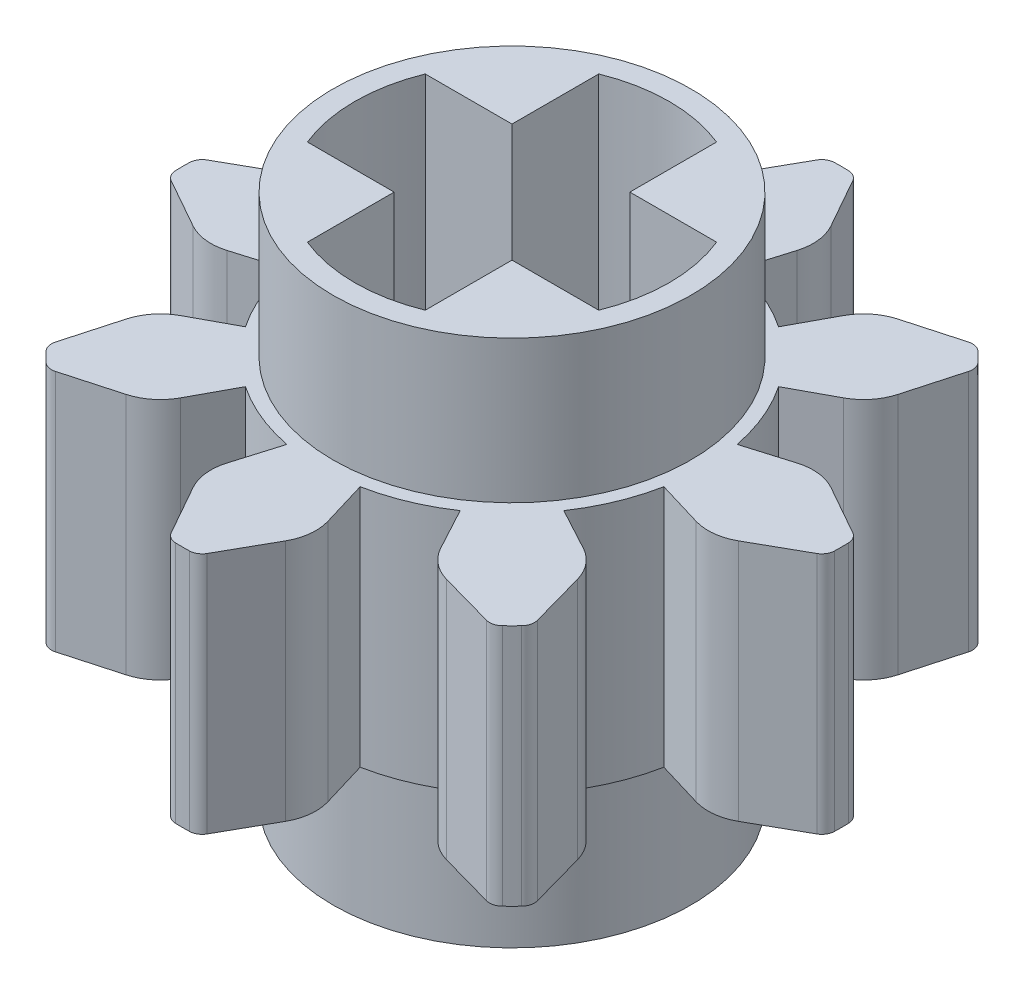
from build123d import *

# Parameters (mm, degrees)
BOSS_EXTRUDE1_DEPTH = 3.71
SKETCH2_R           = 2.7325
BOSS_EXTRUDE2_DEPTH = 2.1775
BOSS_EXTRUDE3_START = 2.1775
SKETCH3_R           = 2.7325
BOSS_EXTRUDE3_DEPTH = 2.1775
FILLET5_R           = 0.2
FILLET6_R           = 0.2
FILLET7_R           = 0.2
FILLET8_R           = 0.2
FILLET9_R           = 0.2
FILLET10_R          = 0.2
FILLET11_R          = 0.2
FILLET12_R          = 0.2
FILLET13_R          = 0.2
FILLET14_R          = 0.2
FILLET15_R          = 0.2
FILLET16_R          = 0.2
FILLET17_R          = 0.2
FILLET19_R          = 0.2
FILLET22_R          = 0.2
FILLET23_R          = 0.2
FILLET25_R          = 0.75
FILLET26_R          = 0.75
FILLET27_R          = 0.75
FILLET28_R          = 0.75
FILLET29_R          = 0.75
FILLET30_R          = 0.75
FILLET31_R          = 0.75
FILLET32_R          = 0.75
FILLET33_R          = 0.75
FILLET34_R          = 0.75
FILLET35_R          = 0.75
FILLET36_R          = 0.75
FILLET37_R          = 0.75
FILLET38_R          = 0.75
FILLET39_R          = 0.75
FILLET40_R          = 0.75
CUT_EXTRUDE1_DEPTH  = 11.756223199


with BuildPart() as part:
    # Sketch1 → Boss-Extrude1 (new body)
    with BuildSketch(Plane(origin=(0, 1.855, 0), x_dir=(-1, 0, 0), z_dir=(0, 1, 0))):
        with BuildLine():
            Line((5.027710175, 0.219514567), (3.888098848, 0.861970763))
            Line((3.888098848, 0.861970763), (2.878621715, 0.559547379))
            ThreePointArc((2.878621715, 0.559547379), (2.709276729, 1.122219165), (2.431152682, 1.639833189))
            Line((2.431152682, 1.639833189), (3.358806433, 2.13979569))
            Line((3.358806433, 2.13979569), (3.710348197, 3.39990772))
            ThreePointArc((3.710348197, 3.39990772), (3.558514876, 3.558514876), (3.39990772, 3.710348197))
            Line((3.39990772, 3.710348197), (2.13979569, 3.358806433))
            Line((2.13979569, 3.358806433), (1.639833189, 2.431152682))
            ThreePointArc((1.639833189, 2.431152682), (1.122219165, 2.709276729), (0.559547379, 2.878621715))
            Line((0.559547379, 2.878621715), (0.861970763, 3.888098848))
            Line((0.861970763, 3.888098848), (0.219514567, 5.027710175))
            ThreePointArc((0.219514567, 5.027710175), (0, 5.0325), (-0.219514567, 5.027710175))
            Line((-0.219514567, 5.027710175), (-0.861970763, 3.888098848))
            Line((-0.861970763, 3.888098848), (-0.559547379, 2.878621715))
            ThreePointArc((-0.559547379, 2.878621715), (-1.122219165, 2.709276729), (-1.639833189, 2.431152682))
            Line((-1.639833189, 2.431152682), (-2.13979569, 3.358806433))
            Line((-2.13979569, 3.358806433), (-3.39990772, 3.710348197))
            ThreePointArc((-3.39990772, 3.710348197), (-3.558514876, 3.558514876), (-3.710348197, 3.39990772))
            Line((-3.710348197, 3.39990772), (-3.358806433, 2.13979569))
            Line((-3.358806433, 2.13979569), (-2.431152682, 1.639833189))
            ThreePointArc((-2.431152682, 1.639833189), (-2.709276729, 1.122219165), (-2.878621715, 0.559547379))
            Line((-2.878621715, 0.559547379), (-3.888098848, 0.861970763))
            Line((-3.888098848, 0.861970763), (-5.027710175, 0.219514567))
            ThreePointArc((-5.027710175, 0.219514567), (-5.0325, 0), (-5.027710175, -0.219514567))
            Line((-5.027710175, -0.219514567), (-3.888098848, -0.861970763))
            Line((-3.888098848, -0.861970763), (-2.878621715, -0.559547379))
            ThreePointArc((-2.878621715, -0.559547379), (-2.709276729, -1.122219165), (-2.431152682, -1.639833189))
            Line((-2.431152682, -1.639833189), (-3.358806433, -2.13979569))
            Line((-3.358806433, -2.13979569), (-3.710348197, -3.39990772))
            ThreePointArc((-3.710348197, -3.39990772), (-3.558514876, -3.558514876), (-3.39990772, -3.710348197))
            Line((-3.39990772, -3.710348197), (-2.13979569, -3.358806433))
            Line((-2.13979569, -3.358806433), (-1.639833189, -2.431152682))
            ThreePointArc((-1.639833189, -2.431152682), (-1.122219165, -2.709276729), (-0.559547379, -2.878621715))
            Line((-0.559547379, -2.878621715), (-0.861970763, -3.888098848))
            Line((-0.861970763, -3.888098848), (-0.219514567, -5.027710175))
            ThreePointArc((-0.219514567, -5.027710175), (0, -5.0325), (0.219514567, -5.027710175))
            Line((0.219514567, -5.027710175), (0.861970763, -3.888098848))
            Line((0.861970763, -3.888098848), (0.559547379, -2.878621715))
            ThreePointArc((0.559547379, -2.878621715), (1.122219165, -2.709276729), (1.639833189, -2.431152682))
            Line((1.639833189, -2.431152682), (2.13979569, -3.358806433))
            Line((2.13979569, -3.358806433), (3.39990772, -3.710348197))
            ThreePointArc((3.39990772, -3.710348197), (3.558514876, -3.558514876), (3.710348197, -3.39990772))
            Line((3.710348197, -3.39990772), (3.358806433, -2.13979569))
            Line((3.358806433, -2.13979569), (2.431152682, -1.639833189))
            ThreePointArc((2.431152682, -1.639833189), (2.709276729, -1.122219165), (2.878621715, -0.559547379))
            Line((2.878621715, -0.559547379), (3.888098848, -0.861970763))
            Line((3.888098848, -0.861970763), (5.027710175, -0.219514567))
            ThreePointArc((5.027710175, -0.219514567), (5.0325, 0), (5.027710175, 0.219514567))
        make_face()
    extrude(amount=-BOSS_EXTRUDE1_DEPTH)

    # Sketch2 → Boss-Extrude2 (add)
    with BuildSketch(Plane(origin=(0, 1.855, 0), x_dir=(-1, 0, 0), z_dir=(0, 1, 0))):
        with Locations(Location((0, 0, 0), (0, 0, 90))):
            Circle(SKETCH2_R)
    extrude(amount=BOSS_EXTRUDE2_DEPTH)

    # Sketch3 → Boss-Extrude3 (add)
    with BuildSketch(Plane.XZ.offset(1.855).offset(BOSS_EXTRUDE3_START)):
        with Locations(Location((0, 0, 0), (0, 0, 90))):
            Circle(SKETCH3_R)
    extrude(amount=-BOSS_EXTRUDE3_DEPTH)

    # Fillet5
    fillet5_edges = [part.edges().sort_by_distance(p)[0] for p in [
        (-3.710348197, 0, -3.39990772),
    ]]
    fillet(fillet5_edges, radius=FILLET5_R)

    # Fillet6
    fillet6_edges = [part.edges().sort_by_distance(p)[0] for p in [
        (5.027710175, 0, -0.219514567),
    ]]
    fillet(fillet6_edges, radius=FILLET6_R)

    # Fillet7
    fillet7_edges = [part.edges().sort_by_distance(p)[0] for p in [
        (-0.219514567, 0, -5.027710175),
    ]]
    fillet(fillet7_edges, radius=FILLET7_R)

    # Fillet8
    fillet8_edges = [part.edges().sort_by_distance(p)[0] for p in [
        (0.219514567, 0, 5.027710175),
    ]]
    fillet(fillet8_edges, radius=FILLET8_R)

    # Fillet9
    fillet9_edges = [part.edges().sort_by_distance(p)[0] for p in [
        (-5.027710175, 0, -0.219514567),
    ]]
    fillet(fillet9_edges, radius=FILLET9_R)

    # Fillet10
    fillet10_edges = [part.edges().sort_by_distance(p)[0] for p in [
        (3.710348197, 0, 3.39990772),
    ]]
    fillet(fillet10_edges, radius=FILLET10_R)

    # Fillet11
    fillet11_edges = [part.edges().sort_by_distance(p)[0] for p in [
        (0.219514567, 0, -5.027710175),
    ]]
    fillet(fillet11_edges, radius=FILLET11_R)

    # Fillet12
    fillet12_edges = [part.edges().sort_by_distance(p)[0] for p in [
        (-3.710348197, 0, 3.39990772),
    ]]
    fillet(fillet12_edges, radius=FILLET12_R)

    # Fillet13
    fillet13_edges = [part.edges().sort_by_distance(p)[0] for p in [
        (3.39990772, 0, 3.710348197),
    ]]
    fillet(fillet13_edges, radius=FILLET13_R)

    # Fillet14
    fillet14_edges = [part.edges().sort_by_distance(p)[0] for p in [
        (-0.219514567, 0, 5.027710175),
    ]]
    fillet(fillet14_edges, radius=FILLET14_R)

    # Fillet15
    fillet15_edges = [part.edges().sort_by_distance(p)[0] for p in [
        (3.39990772, 0, -3.710348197),
    ]]
    fillet(fillet15_edges, radius=FILLET15_R)

    # Fillet16
    fillet16_edges = [part.edges().sort_by_distance(p)[0] for p in [
        (3.710348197, 0, -3.39990772),
    ]]
    fillet(fillet16_edges, radius=FILLET16_R)

    # Fillet17
    fillet17_edges = [part.edges().sort_by_distance(p)[0] for p in [
        (-3.39990772, 0, 3.710348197),
    ]]
    fillet(fillet17_edges, radius=FILLET17_R)

    # Fillet19
    fillet19_edges = [part.edges().sort_by_distance(p)[0] for p in [
        (5.027710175, 0, 0.219514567),
    ]]
    fillet(fillet19_edges, radius=FILLET19_R)

    # Fillet22
    fillet22_edges = [part.edges().sort_by_distance(p)[0] for p in [
        (-3.39990772, 0, -3.710348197),
    ]]
    fillet(fillet22_edges, radius=FILLET22_R)

    # Fillet23
    fillet23_edges = [part.edges().sort_by_distance(p)[0] for p in [
        (-5.027710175, 0, 0.219514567),
    ]]
    fillet(fillet23_edges, radius=FILLET23_R)

    # Fillet25
    fillet25_edges = [part.edges().sort_by_distance(p)[0] for p in [
        (-2.13979569, 0, 3.358806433),
    ]]
    fillet(fillet25_edges, radius=FILLET25_R)

    # Fillet26
    fillet26_edges = [part.edges().sort_by_distance(p)[0] for p in [
        (0.861970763, 0, -3.888098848),
    ]]
    fillet(fillet26_edges, radius=FILLET26_R)

    # Fillet27
    fillet27_edges = [part.edges().sort_by_distance(p)[0] for p in [
        (2.13979569, 0, 3.358806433),
    ]]
    fillet(fillet27_edges, radius=FILLET27_R)

    # Fillet28
    fillet28_edges = [part.edges().sort_by_distance(p)[0] for p in [
        (-3.888098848, 0, -0.861970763),
    ]]
    fillet(fillet28_edges, radius=FILLET28_R)

    # Fillet29
    fillet29_edges = [part.edges().sort_by_distance(p)[0] for p in [
        (2.13979569, 0, -3.358806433),
    ]]
    fillet(fillet29_edges, radius=FILLET29_R)

    # Fillet30
    fillet30_edges = [part.edges().sort_by_distance(p)[0] for p in [
        (-3.358806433, 0, -2.13979569),
    ]]
    fillet(fillet30_edges, radius=FILLET30_R)

    # Fillet31
    fillet31_edges = [part.edges().sort_by_distance(p)[0] for p in [
        (3.358806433, 0, 2.13979569),
    ]]
    fillet(fillet31_edges, radius=FILLET31_R)

    # Fillet32
    fillet32_edges = [part.edges().sort_by_distance(p)[0] for p in [
        (-0.861970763, 0, 3.888098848),
    ]]
    fillet(fillet32_edges, radius=FILLET32_R)

    # Fillet33
    fillet33_edges = [part.edges().sort_by_distance(p)[0] for p in [
        (3.358806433, 0, -2.13979569),
    ]]
    fillet(fillet33_edges, radius=FILLET33_R)

    # Fillet34
    fillet34_edges = [part.edges().sort_by_distance(p)[0] for p in [
        (0.861970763, 0, 3.888098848),
    ]]
    fillet(fillet34_edges, radius=FILLET34_R)

    # Fillet35
    fillet35_edges = [part.edges().sort_by_distance(p)[0] for p in [
        (3.888098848, 0, 0.861970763),
    ]]
    fillet(fillet35_edges, radius=FILLET35_R)

    # Fillet36
    fillet36_edges = [part.edges().sort_by_distance(p)[0] for p in [
        (-3.358806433, 0, 2.13979569),
    ]]
    fillet(fillet36_edges, radius=FILLET36_R)

    # Fillet37
    fillet37_edges = [part.edges().sort_by_distance(p)[0] for p in [
        (3.888098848, 0, -0.861970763),
    ]]
    fillet(fillet37_edges, radius=FILLET37_R)

    # Fillet38
    fillet38_edges = [part.edges().sort_by_distance(p)[0] for p in [
        (-0.861970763, 0, -3.888098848),
    ]]
    fillet(fillet38_edges, radius=FILLET38_R)

    # Fillet39
    fillet39_edges = [part.edges().sort_by_distance(p)[0] for p in [
        (-2.13979569, 0, -3.358806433),
    ]]
    fillet(fillet39_edges, radius=FILLET39_R)

    # Fillet40
    fillet40_edges = [part.edges().sort_by_distance(p)[0] for p in [
        (-3.888098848, 0, 0.861970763),
    ]]
    fillet(fillet40_edges, radius=FILLET40_R)

    # Sketch4 → Cut-Extrude1 (cut, through all)
    with BuildSketch(Plane.XZ.offset(4.0325)):
        with BuildLine():
            Line((-2.224859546, 0.9), (-0.9, 0.9))
            Line((-0.9, 0.9), (-0.9, 2.224859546))
            ThreePointArc((-0.9, 2.224859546), (0, 2.4), (0.9, 2.224859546))
            Line((0.9, 2.224859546), (0.9, 0.9))
            Line((0.9, 0.9), (2.224859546, 0.9))
            ThreePointArc((2.224859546, 0.9), (2.4, 0), (2.224859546, -0.9))
            Line((2.224859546, -0.9), (0.9, -0.9))
            Line((0.9, -0.9), (0.9, -2.224859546))
            ThreePointArc((0.9, -2.224859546), (0, -2.4), (-0.9, -2.224859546))
            Line((-0.9, -2.224859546), (-0.9, -0.9))
            Line((-0.9, -0.9), (-2.224859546, -0.9))
            ThreePointArc((-2.224859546, -0.9), (-2.4, 0), (-2.224859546, 0.9))
        make_face()
    extrude(amount=-CUT_EXTRUDE1_DEPTH, mode=Mode.SUBTRACT)


solid = part.part
